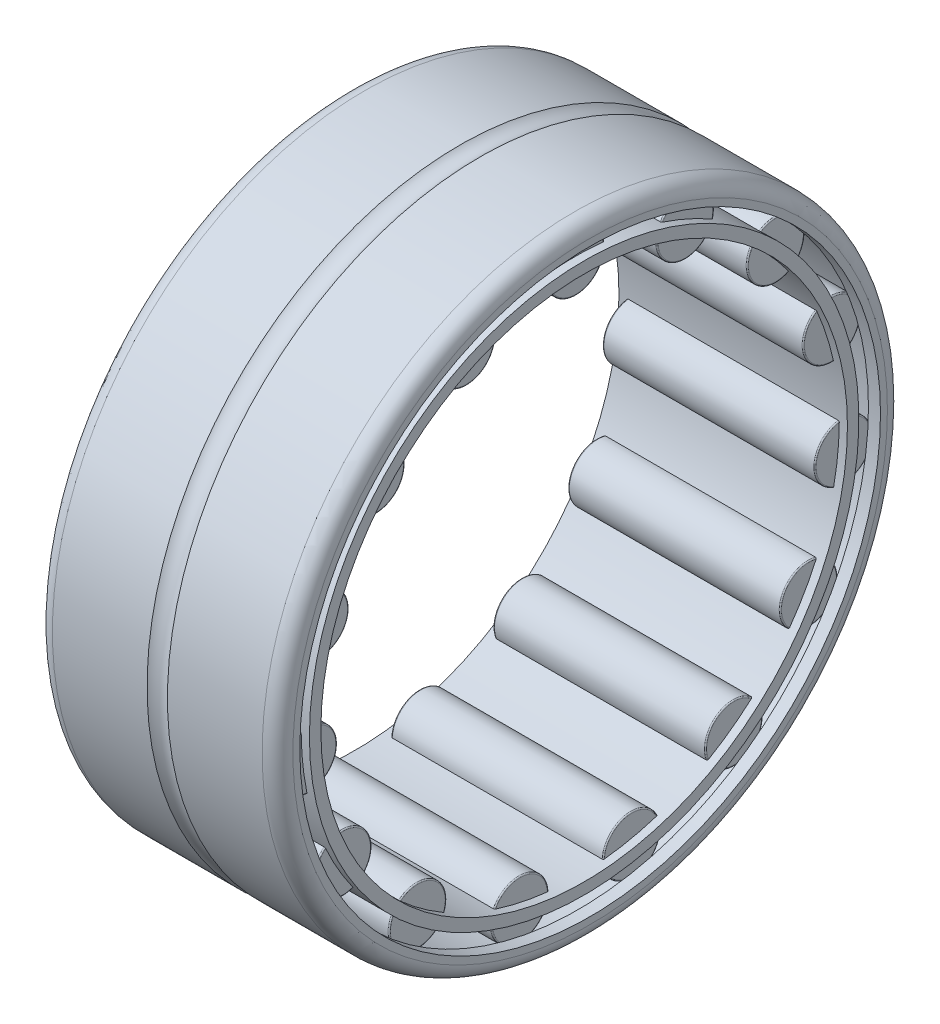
from build123d import *

# Parameters (mm, degrees)
CAGSPISKE_W           = 30.1625
CAGSPISKE_H           = 1.5113
ROLLERSDETAILED_COUNT = 15
ROLLERSDETAILED_ANGLE = 336


with BuildPart() as part:
    # InnRacSke → Race (revolve)
    with BuildSketch(Plane.XY, mode=Mode.PRIVATE) as race_sk:
        with BuildLine():
            Line((-14.2875, 38.3286), (-15.875, 38.3286))
            Line((-15.875, 38.3286), (-15.875, 39.243))
            ThreePointArc((-15.875, 39.243), (-15.279840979, 40.679840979), (-13.843, 41.275))
            Line((-13.843, 41.275), (-1.344041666, 41.275))
            ThreePointArc((-1.344041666, 41.275), (0, 40.767), (1.344041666, 41.275))
            Line((1.344041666, 41.275), (13.843, 41.275))
            ThreePointArc((13.843, 41.275), (15.279840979, 40.679840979), (15.875, 39.243))
            Line((15.875, 39.243), (15.875, 38.3286))
            Line((15.875, 38.3286), (14.2875, 38.3286))
            Line((14.2875, 38.3286), (14.2875, 39.2811))
            Line((14.2875, 39.2811), (-14.2875, 39.2811))
            Line((-14.2875, 39.2811), (-14.2875, 38.3286))
        make_face()
    revolve(race_sk.sketch.rotate(Axis((-31.75, 0, 0), (1, 0, 0)), 270), axis=Axis((-31.75, 0, 0), (1, 0, 0)))

    # RolDetSke → RollerDetailed (revolve)
    with BuildSketch(Plane.XY, mode=Mode.PRIVATE) as rollerdetailed_sk:
        with BuildLine():
            Line((-14.00175, 39.14267), (-14.00175, 35.51555))
            Line((-14.00175, 35.51555), (14.00175, 35.51555))
            Line((14.00175, 35.51555), (14.00175, 39.14267))
            ThreePointArc((14.00175, 39.14267), (13.957485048, 39.249535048), (13.85062, 39.2938))
            Line((13.85062, 39.2938), (-13.85062, 39.2938))
            ThreePointArc((-13.85062, 39.2938), (-13.957485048, 39.249535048), (-14.00175, 39.14267))
        make_face()
    rollerdetailed = revolve(rollerdetailed_sk.sketch.rotate(Axis((-28.575, 35.51555, 0), (1, 0, 0)), 270), axis=Axis((-28.575, 35.51555, 0), (1, 0, 0)))

    # CagSpiSke → CageSpine (revolve)
    with BuildSketch(Plane.XY, mode=Mode.PRIVATE) as cagespine_sk:
        with Locations((0, 35.51555)):
            Rectangle(CAGSPISKE_W, CAGSPISKE_H)
    revolve(cagespine_sk.sketch.rotate(Axis((-31.75, 0, 0), (1, 0, 0)), 90), axis=Axis((-31.75, 0, 0), (1, 0, 0)))

    # RollersDetailed: RollerDetailed ×15 about axis
    rollersdetailed_axis = Axis((-50, 0, 0), (1, 0, 0))
    for i in range(1, ROLLERSDETAILED_COUNT):
        add(rollerdetailed.rotate(rollersdetailed_axis, i * ROLLERSDETAILED_ANGLE / (ROLLERSDETAILED_COUNT - 1)))


solid = part.part
